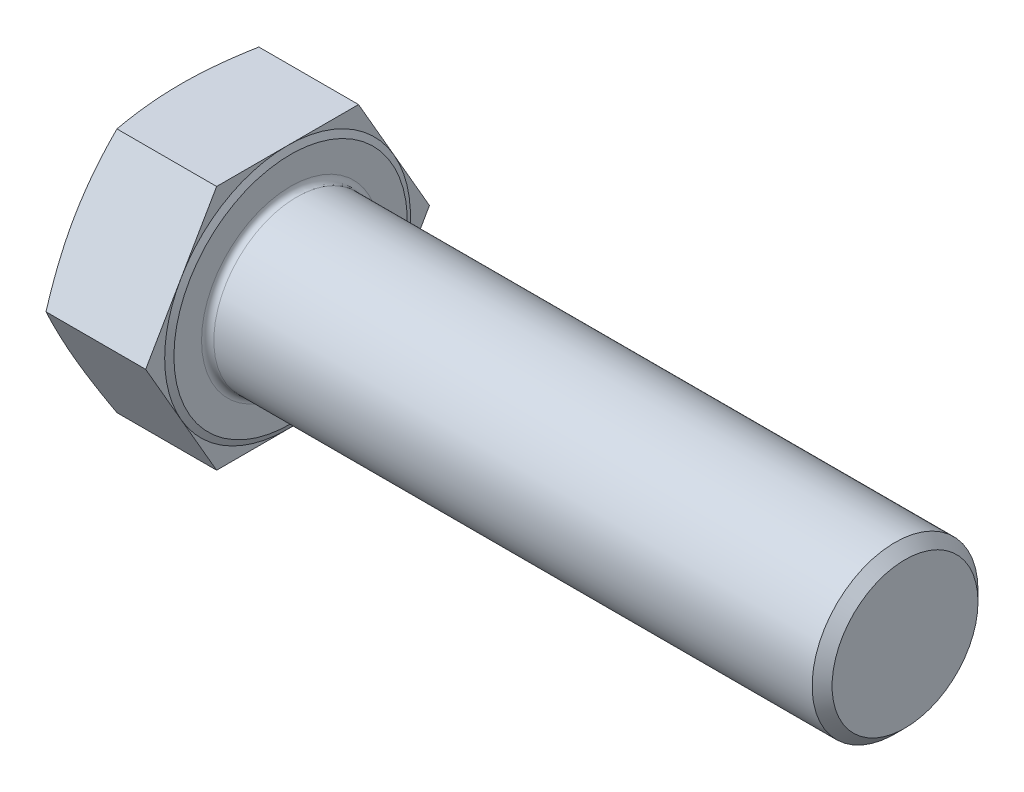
ISO-10303-21;
HEADER;
FILE_DESCRIPTION(('STEP AP214'),'2;1');
FILE_NAME('part.step','',(''),(''),'','','');
FILE_SCHEMA(('AUTOMOTIVE_DESIGN { 1 0 10303 214 1 1 1 1 }'));
ENDSEC;
DATA;
#1=APPLICATION_CONTEXT('core data for automotive mechanical design processes');
#2=APPLICATION_PROTOCOL_DEFINITION('international standard','automotive_design',2000,#1);
#3=PRODUCT_CONTEXT('',#1,'mechanical');
#4=PRODUCT('Part','Part','',(#3));
#5=PRODUCT_RELATED_PRODUCT_CATEGORY('part','',(#4));
#6=PRODUCT_DEFINITION_FORMATION('','',#4);
#7=PRODUCT_DEFINITION_CONTEXT('part definition',#1,'design');
#8=PRODUCT_DEFINITION('design','',#6,#7);
#9=PRODUCT_DEFINITION_SHAPE('','',#8);
#10=(LENGTH_UNIT() NAMED_UNIT(*) SI_UNIT(.MILLI.,.METRE.));
#11=(NAMED_UNIT(*) PLANE_ANGLE_UNIT() SI_UNIT($,.RADIAN.));
#12=(NAMED_UNIT(*) SI_UNIT($,.STERADIAN.) SOLID_ANGLE_UNIT());
#13=UNCERTAINTY_MEASURE_WITH_UNIT(LENGTH_MEASURE(1.E-05),#10,'distance_accuracy_value','');
#14=(GEOMETRIC_REPRESENTATION_CONTEXT(3) GLOBAL_UNCERTAINTY_ASSIGNED_CONTEXT((#13)) GLOBAL_UNIT_ASSIGNED_CONTEXT((#10,
#11,#12)) REPRESENTATION_CONTEXT('',''));
#15=CARTESIAN_POINT('',(0.,0.,0.));
#16=DIRECTION('',(0.,0.,1.));
#17=DIRECTION('',(1.,0.,0.));
#18=AXIS2_PLACEMENT_3D('',#15,#16,#17);
#19=CARTESIAN_POINT('',(17.85,0.,0.));
#20=DIRECTION('',(1.,0.,0.));
#21=DIRECTION('',(0.,0.,-1.));
#22=AXIS2_PLACEMENT_3D('',#19,#20,#21);
#23=PLANE('',#22);
#24=CARTESIAN_POINT('',(17.85,0.,0.));
#25=DIRECTION('',(1.,0.,0.));
#26=DIRECTION('',(0.,0.,-1.));
#27=AXIS2_PLACEMENT_3D('',#24,#25,#26);
#28=CIRCLE('',#27,14.5);
#29=CARTESIAN_POINT('',(17.85,0.,-14.5));
#30=VERTEX_POINT('',#29);
#31=EDGE_CURVE('E188',#30,#30,#28,.F.);
#32=ORIENTED_EDGE('',*,*,#31,.T.);
#33=EDGE_LOOP('',(#32));
#34=FACE_BOUND('',#33,.T.);
#35=CARTESIAN_POINT('',(17.85,0.,0.));
#36=DIRECTION('',(-1.,0.,0.));
#37=DIRECTION('',(0.,0.,1.));
#38=AXIS2_PLACEMENT_3D('',#35,#36,#37);
#39=CIRCLE('',#38,19.);
#40=CARTESIAN_POINT('',(17.85,0.,19.));
#41=VERTEX_POINT('',#40);
#42=EDGE_CURVE('E139',#41,#41,#39,.T.);
#43=ORIENTED_EDGE('',*,*,#42,.F.);
#44=EDGE_LOOP('',(#43));
#45=FACE_BOUND('',#44,.T.);
#46=ADVANCED_FACE('F33',(#34,#45),#23,.T.);
#47=CARTESIAN_POINT('',(17.35,0.,-23.0940107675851));
#48=DIRECTION('',(1.,0.,0.));
#49=DIRECTION('',(0.,0.,-1.));
#50=AXIS2_PLACEMENT_3D('',#47,#48,#49);
#51=PLANE('',#50);
#52=DIRECTION('',(0.,-0.866025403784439,0.5));
#53=VECTOR('',#52,1.);
#54=CARTESIAN_POINT('',(17.35,20.,11.5470053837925));
#55=LINE('',#54,#53);
#56=CARTESIAN_POINT('',(17.35,20.,11.5470053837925));
#57=VERTEX_POINT('',#56);
#58=CARTESIAN_POINT('',(17.35,9.99999999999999,17.3205080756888));
#59=VERTEX_POINT('',#58);
#60=EDGE_CURVE('E138',#57,#59,#55,.T.);
#61=ORIENTED_EDGE('',*,*,#60,.T.);
#62=CARTESIAN_POINT('',(17.35,0.,0.));
#63=DIRECTION('',(-1.,0.,0.));
#64=DIRECTION('',(0.,0.,1.));
#65=AXIS2_PLACEMENT_3D('',#62,#63,#64);
#66=CIRCLE('',#65,20.);
#67=CARTESIAN_POINT('',(17.35,20.,0.));
#68=VERTEX_POINT('',#67);
#69=EDGE_CURVE('E49',#59,#68,#66,.T.);
#70=ORIENTED_EDGE('',*,*,#69,.T.);
#71=DIRECTION('',(0.,0.,1.));
#72=VECTOR('',#71,1.);
#73=CARTESIAN_POINT('',(17.35,20.,-11.5470053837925));
#74=LINE('',#73,#72);
#75=EDGE_CURVE('E135',#68,#57,#74,.T.);
#76=ORIENTED_EDGE('',*,*,#75,.T.);
#77=EDGE_LOOP('',(#61,#70,#76));
#78=FACE_BOUND('',#77,.T.);
#79=ADVANCED_FACE('F134',(#78),#51,.T.);
#80=CARTESIAN_POINT('',(17.35,20.,-11.5470053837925));
#81=VERTEX_POINT('',#80);
#82=EDGE_CURVE('E145',#81,#68,#74,.T.);
#83=ORIENTED_EDGE('',*,*,#82,.T.);
#84=CARTESIAN_POINT('',(17.35,10.,-17.3205080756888));
#85=VERTEX_POINT('',#84);
#86=EDGE_CURVE('E122',#68,#85,#66,.T.);
#87=ORIENTED_EDGE('',*,*,#86,.T.);
#88=DIRECTION('',(0.,0.866025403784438,0.5));
#89=VECTOR('',#88,1.);
#90=CARTESIAN_POINT('',(17.35,0.,-23.0940107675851));
#91=LINE('',#90,#89);
#92=EDGE_CURVE('E151',#85,#81,#91,.T.);
#93=ORIENTED_EDGE('',*,*,#92,.T.);
#94=EDGE_LOOP('',(#83,#87,#93));
#95=FACE_BOUND('',#94,.T.);
#96=ADVANCED_FACE('F150',(#95),#51,.T.);
#97=CARTESIAN_POINT('',(17.35,0.,-23.0940107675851));
#98=VERTEX_POINT('',#97);
#99=EDGE_CURVE('E148',#98,#85,#91,.T.);
#100=ORIENTED_EDGE('',*,*,#99,.T.);
#101=CARTESIAN_POINT('',(17.35,-10.,-17.3205080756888));
#102=VERTEX_POINT('',#101);
#103=EDGE_CURVE('E125',#85,#102,#66,.T.);
#104=ORIENTED_EDGE('',*,*,#103,.T.);
#105=DIRECTION('',(0.,0.866025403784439,-0.5));
#106=VECTOR('',#105,1.);
#107=CARTESIAN_POINT('',(17.35,-20.,-11.5470053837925));
#108=LINE('',#107,#106);
#109=EDGE_CURVE('E306',#102,#98,#108,.T.);
#110=ORIENTED_EDGE('',*,*,#109,.T.);
#111=EDGE_LOOP('',(#100,#104,#110));
#112=FACE_BOUND('',#111,.T.);
#113=ADVANCED_FACE('F337',(#112),#51,.T.);
#114=CARTESIAN_POINT('',(17.35,-20.,-11.5470053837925));
#115=VERTEX_POINT('',#114);
#116=EDGE_CURVE('E304',#115,#102,#108,.T.);
#117=ORIENTED_EDGE('',*,*,#116,.T.);
#118=CARTESIAN_POINT('',(17.35,-20.,0.));
#119=VERTEX_POINT('',#118);
#120=EDGE_CURVE('E338',#102,#119,#66,.T.);
#121=ORIENTED_EDGE('',*,*,#120,.T.);
#122=DIRECTION('',(0.,0.,-1.));
#123=VECTOR('',#122,1.);
#124=CARTESIAN_POINT('',(17.35,-20.,11.5470053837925));
#125=LINE('',#124,#123);
#126=EDGE_CURVE('E162',#119,#115,#125,.T.);
#127=ORIENTED_EDGE('',*,*,#126,.T.);
#128=EDGE_LOOP('',(#117,#121,#127));
#129=FACE_BOUND('',#128,.T.);
#130=ADVANCED_FACE('F352',(#129),#51,.T.);
#131=CARTESIAN_POINT('',(17.35,-20.,11.5470053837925));
#132=VERTEX_POINT('',#131);
#133=EDGE_CURVE('E163',#132,#119,#125,.T.);
#134=ORIENTED_EDGE('',*,*,#133,.T.);
#135=CARTESIAN_POINT('',(17.35,-10.,17.3205080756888));
#136=VERTEX_POINT('',#135);
#137=EDGE_CURVE('E339',#119,#136,#66,.T.);
#138=ORIENTED_EDGE('',*,*,#137,.T.);
#139=DIRECTION('',(0.,-0.866025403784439,-0.5));
#140=VECTOR('',#139,1.);
#141=CARTESIAN_POINT('',(17.35,0.,23.094010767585));
#142=LINE('',#141,#140);
#143=EDGE_CURVE('E158',#136,#132,#142,.T.);
#144=ORIENTED_EDGE('',*,*,#143,.T.);
#145=EDGE_LOOP('',(#134,#138,#144));
#146=FACE_BOUND('',#145,.T.);
#147=ADVANCED_FACE('F347',(#146),#51,.T.);
#148=CARTESIAN_POINT('',(17.35,0.,23.094010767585));
#149=VERTEX_POINT('',#148);
#150=EDGE_CURVE('E159',#149,#136,#142,.T.);
#151=ORIENTED_EDGE('',*,*,#150,.T.);
#152=EDGE_CURVE('E140',#136,#59,#66,.T.);
#153=ORIENTED_EDGE('',*,*,#152,.T.);
#154=EDGE_CURVE('E153',#59,#149,#55,.T.);
#155=ORIENTED_EDGE('',*,*,#154,.T.);
#156=EDGE_LOOP('',(#151,#153,#155));
#157=FACE_BOUND('',#156,.T.);
#158=ADVANCED_FACE('F213',(#157),#51,.T.);
#159=CARTESIAN_POINT('',(17.35,-20.,-11.5470053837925));
#160=DIRECTION('',(0.,0.5,0.866025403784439));
#161=DIRECTION('',(0.,-0.866025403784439,0.5));
#162=AXIS2_PLACEMENT_3D('',#159,#160,#161);
#163=PLANE('',#162);
#164=CARTESIAN_POINT('',(1.12616985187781,0.000199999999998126,-23.0941262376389));
#165=CARTESIAN_POINT('',(1.03913935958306,-0.413988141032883,-22.8549946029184));
#166=CARTESIAN_POINT('',(0.956022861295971,-0.828784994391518,-22.6155115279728));
#167=CARTESIAN_POINT('',(0.79847887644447,-1.65965264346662,-22.1358098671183));
#168=CARTESIAN_POINT('',(0.724052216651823,-2.07572355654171,-21.8955912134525));
#169=CARTESIAN_POINT('',(0.515026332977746,-3.32638990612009,-21.173518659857));
#170=CARTESIAN_POINT('',(0.39480393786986,-4.16286638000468,-20.6905787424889));
#171=CARTESIAN_POINT('',(0.248695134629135,-5.41653139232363,-19.966774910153));
#172=CARTESIAN_POINT('',(0.20582014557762,-5.83227350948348,-19.7267460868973));
#173=CARTESIAN_POINT('',(0.1317782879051,-6.66453397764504,-19.2462402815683));
#174=CARTESIAN_POINT('',(0.100610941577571,-7.08105229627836,-19.0057633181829));
#175=CARTESIAN_POINT('',(0.0505287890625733,-7.91449906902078,-18.5245725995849));
#176=CARTESIAN_POINT('',(0.0316097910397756,-8.33142733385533,-18.2838589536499));
#177=CARTESIAN_POINT('',(0.00634541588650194,-9.16557039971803,-17.8022662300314));
#178=CARTESIAN_POINT('',(0.,-9.58278519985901,-17.5613871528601));
#179=CARTESIAN_POINT('',(0.,-10.417214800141,-17.0796289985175));
#180=CARTESIAN_POINT('',(0.00634541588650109,-10.834429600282,-16.8387499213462));
#181=CARTESIAN_POINT('',(0.0316097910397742,-11.6685726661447,-16.3571571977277));
#182=CARTESIAN_POINT('',(0.0505287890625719,-12.0855009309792,-16.1164435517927));
#183=CARTESIAN_POINT('',(0.100610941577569,-12.9189477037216,-15.6352528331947));
#184=CARTESIAN_POINT('',(0.131778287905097,-13.335466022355,-15.3947758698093));
#185=CARTESIAN_POINT('',(0.205820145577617,-14.1677264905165,-14.9142700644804));
#186=CARTESIAN_POINT('',(0.248695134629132,-14.5834686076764,-14.6742412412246));
#187=CARTESIAN_POINT('',(0.394803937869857,-15.8371336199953,-13.9504374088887));
#188=CARTESIAN_POINT('',(0.515026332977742,-16.6736100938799,-13.4674974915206));
#189=CARTESIAN_POINT('',(0.724052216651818,-17.9242764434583,-12.7454249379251));
#190=CARTESIAN_POINT('',(0.798478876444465,-18.3403473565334,-12.5052062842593));
#191=CARTESIAN_POINT('',(0.956022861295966,-19.1712150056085,-12.0255046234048));
#192=CARTESIAN_POINT('',(1.03913935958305,-19.5860118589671,-11.7860215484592));
#193=CARTESIAN_POINT('',(1.12616985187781,-20.0002,-11.5468899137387));
#194=B_SPLINE_CURVE_WITH_KNOTS('',3,(#164,#165,#166,#167,#168,#169,#170,#171,#172,#173,#174,
#175,#176,#177,#178,#179,#180,#181,#182,#183,#184,#185,#186,#187,#188,#189,#190,#191,#192,#193),
.UNSPECIFIED.,.F.,.F.,(4,2,2,2,2,2,2,2,2,2,2,2,2,2,4),(0.,1.45830867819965,2.91675599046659,
5.83566674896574,7.28145814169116,8.72719053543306,10.1724278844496,11.6176607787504,
13.0628936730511,14.5081310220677,15.9538634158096,17.399654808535,20.3185655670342,
21.7770128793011,23.2353215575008),.UNSPECIFIED.);
#195=CARTESIAN_POINT('',(1.12612782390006,0.,-23.0940107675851));
#196=VERTEX_POINT('',#195);
#197=CARTESIAN_POINT('',(0.,-10.,-17.3205080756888));
#198=VERTEX_POINT('',#197);
#199=EDGE_CURVE('E321',#196,#198,#194,.T.);
#200=ORIENTED_EDGE('',*,*,#199,.F.);
#201=DIRECTION('',(-1.,0.,0.));
#202=VECTOR('',#201,1.);
#203=CARTESIAN_POINT('',(17.35,0.,-23.0940107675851));
#204=LINE('',#203,#202);
#205=EDGE_CURVE('E178',#98,#196,#204,.T.);
#206=ORIENTED_EDGE('',*,*,#205,.F.);
#207=ORIENTED_EDGE('',*,*,#109,.F.);
#208=ORIENTED_EDGE('',*,*,#116,.F.);
#209=DIRECTION('',(-1.,0.,0.));
#210=VECTOR('',#209,1.);
#211=CARTESIAN_POINT('',(17.35,-20.,-11.5470053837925));
#212=LINE('',#211,#210);
#213=CARTESIAN_POINT('',(1.12612782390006,-20.,-11.5470053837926));
#214=VERTEX_POINT('',#213);
#215=EDGE_CURVE('E166',#115,#214,#212,.T.);
#216=ORIENTED_EDGE('',*,*,#215,.T.);
#217=EDGE_CURVE('E246',#198,#214,#194,.T.);
#218=ORIENTED_EDGE('',*,*,#217,.F.);
#219=EDGE_LOOP('',(#200,#206,#207,#208,#216,#218));
#220=FACE_BOUND('',#219,.T.);
#221=ADVANCED_FACE('F35',(#220),#163,.F.);
#222=CARTESIAN_POINT('',(17.35,0.,-23.0940107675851));
#223=DIRECTION('',(0.,-0.5,0.866025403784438));
#224=DIRECTION('',(0.,-0.866025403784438,-0.5));
#225=AXIS2_PLACEMENT_3D('',#222,#223,#224);
#226=PLANE('',#225);
#227=CARTESIAN_POINT('',(1.12616985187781,20.0002,-11.5468899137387));
#228=CARTESIAN_POINT('',(1.03913935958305,19.5860118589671,-11.7860215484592));
#229=CARTESIAN_POINT('',(0.956022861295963,19.1712150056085,-12.0255046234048));
#230=CARTESIAN_POINT('',(0.798478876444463,18.3403473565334,-12.5052062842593));
#231=CARTESIAN_POINT('',(0.724052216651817,17.9242764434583,-12.7454249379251));
#232=CARTESIAN_POINT('',(0.51502633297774,16.6736100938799,-13.4674974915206));
#233=CARTESIAN_POINT('',(0.394803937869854,15.8371336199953,-13.9504374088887));
#234=CARTESIAN_POINT('',(0.248695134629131,14.5834686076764,-14.6742412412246));
#235=CARTESIAN_POINT('',(0.205820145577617,14.1677264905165,-14.9142700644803));
#236=CARTESIAN_POINT('',(0.131778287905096,13.335466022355,-15.3947758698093));
#237=CARTESIAN_POINT('',(0.100610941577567,12.9189477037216,-15.6352528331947));
#238=CARTESIAN_POINT('',(0.0505287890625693,12.0855009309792,-16.1164435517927));
#239=CARTESIAN_POINT('',(0.0316097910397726,11.6685726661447,-16.3571571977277));
#240=CARTESIAN_POINT('',(0.00634541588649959,10.834429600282,-16.8387499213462));
#241=CARTESIAN_POINT('',(0.,10.417214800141,-17.0796289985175));
#242=CARTESIAN_POINT('',(0.,9.58278519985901,-17.5613871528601));
#243=CARTESIAN_POINT('',(0.00634541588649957,9.16557039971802,-17.8022662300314));
#244=CARTESIAN_POINT('',(0.0316097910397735,8.33142733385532,-18.2838589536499));
#245=CARTESIAN_POINT('',(0.0505287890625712,7.91449906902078,-18.5245725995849));
#246=CARTESIAN_POINT('',(0.10061094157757,7.08105229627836,-19.0057633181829));
#247=CARTESIAN_POINT('',(0.131778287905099,6.66453397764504,-19.2462402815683));
#248=CARTESIAN_POINT('',(0.20582014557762,5.83227350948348,-19.7267460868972));
#249=CARTESIAN_POINT('',(0.248695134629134,5.41653139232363,-19.9667749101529));
#250=CARTESIAN_POINT('',(0.394803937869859,4.16286638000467,-20.6905787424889));
#251=CARTESIAN_POINT('',(0.515026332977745,3.32638990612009,-21.173518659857));
#252=CARTESIAN_POINT('',(0.724052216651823,2.07572355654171,-21.8955912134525));
#253=CARTESIAN_POINT('',(0.79847887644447,1.65965264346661,-22.1358098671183));
#254=CARTESIAN_POINT('',(0.956022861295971,0.828784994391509,-22.6155115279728));
#255=CARTESIAN_POINT('',(1.03913935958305,0.413988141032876,-22.8549946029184));
#256=CARTESIAN_POINT('',(1.12616985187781,-0.000200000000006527,-23.0941262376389));
#257=B_SPLINE_CURVE_WITH_KNOTS('',3,(#227,#228,#229,#230,#231,#232,#233,#234,#235,#236,#237,
#238,#239,#240,#241,#242,#243,#244,#245,#246,#247,#248,#249,#250,#251,#252,#253,#254,#255,#256),
.UNSPECIFIED.,.F.,.F.,(4,2,2,2,2,2,2,2,2,2,2,2,2,2,4),(0.,1.45830867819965,2.91675599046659,
5.83566674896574,7.28145814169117,8.72719053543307,10.1724278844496,11.6176607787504,
13.0628936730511,14.5081310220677,15.9538634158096,17.399654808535,20.3185655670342,
21.7770128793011,23.2353215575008),.UNSPECIFIED.);
#258=CARTESIAN_POINT('',(1.12612782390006,20.,-11.5470053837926));
#259=VERTEX_POINT('',#258);
#260=CARTESIAN_POINT('',(0.,10.,-17.3205080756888));
#261=VERTEX_POINT('',#260);
#262=EDGE_CURVE('E261',#259,#261,#257,.T.);
#263=ORIENTED_EDGE('',*,*,#262,.F.);
#264=DIRECTION('',(-1.,0.,0.));
#265=VECTOR('',#264,1.);
#266=CARTESIAN_POINT('',(17.35,20.,-11.5470053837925));
#267=LINE('',#266,#265);
#268=EDGE_CURVE('E176',#81,#259,#267,.T.);
#269=ORIENTED_EDGE('',*,*,#268,.F.);
#270=ORIENTED_EDGE('',*,*,#92,.F.);
#271=ORIENTED_EDGE('',*,*,#99,.F.);
#272=ORIENTED_EDGE('',*,*,#205,.T.);
#273=EDGE_CURVE('E257',#261,#196,#257,.T.);
#274=ORIENTED_EDGE('',*,*,#273,.F.);
#275=EDGE_LOOP('',(#263,#269,#270,#271,#272,#274));
#276=FACE_BOUND('',#275,.T.);
#277=ADVANCED_FACE('F267',(#276),#226,.F.);
#278=CARTESIAN_POINT('',(17.35,20.,-11.5470053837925));
#279=DIRECTION('',(0.,-1.,0.));
#280=DIRECTION('',(0.,0.,-1.));
#281=AXIS2_PLACEMENT_3D('',#278,#279,#280);
#282=PLANE('',#281);
#283=CARTESIAN_POINT('',(6.01758049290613,20.,-30.5724100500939));
#284=CARTESIAN_POINT('',(5.87978017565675,20.,-30.119980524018));
#285=CARTESIAN_POINT('',(5.74281320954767,20.,-29.667297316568));
#286=CARTESIAN_POINT('',(5.47073254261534,20.,-28.7613715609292));
#287=CARTESIAN_POINT('',(5.33561885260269,20.,-28.3081290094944));
#288=CARTESIAN_POINT('',(4.93332011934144,20.,-26.9474252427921));
#289=CARTESIAN_POINT('',(4.66919783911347,20.,-26.0390547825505));
#290=CARTESIAN_POINT('',(4.1505185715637,20.,-24.2177476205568));
#291=CARTESIAN_POINT('',(3.89598035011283,20.,-23.3048055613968));
#292=CARTESIAN_POINT('',(3.39942734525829,20.,-21.4755258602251));
#293=CARTESIAN_POINT('',(3.15741233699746,20.,-20.5591882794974));
#294=CARTESIAN_POINT('',(2.69190185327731,20.,-18.733829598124));
#295=CARTESIAN_POINT('',(2.46821483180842,20.,-17.8248575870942));
#296=CARTESIAN_POINT('',(2.03988475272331,20.,-16.0023904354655));
#297=CARTESIAN_POINT('',(1.83524201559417,20.,-15.0888952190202));
#298=CARTESIAN_POINT('',(1.4497719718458,20.,-13.2571772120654));
#299=CARTESIAN_POINT('',(1.26893654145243,20.,-12.3389561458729));
#300=CARTESIAN_POINT('',(0.936587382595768,20.,-10.4971831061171));
#301=CARTESIAN_POINT('',(0.785072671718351,20.,-9.57363131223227));
#302=CARTESIAN_POINT('',(0.532522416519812,20.,-7.825192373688));
#303=CARTESIAN_POINT('',(0.427731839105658,20.,-7.00085271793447));
#304=CARTESIAN_POINT('',(0.25034635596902,20.,-5.3486876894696));
#305=CARTESIAN_POINT('',(0.177750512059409,20.,-4.52086241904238));
#306=CARTESIAN_POINT('',(0.0682505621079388,20.,-2.86340529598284));
#307=CARTESIAN_POINT('',(0.0313212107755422,20.,-2.03377513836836));
#308=CARTESIAN_POINT('',(-0.00497602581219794,20.,-0.373684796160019));
#309=CARTESIAN_POINT('',(-0.00434417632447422,20.,0.456775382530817));
#310=CARTESIAN_POINT('',(0.034545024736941,20.,2.12101364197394));
#311=CARTESIAN_POINT('',(0.0729931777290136,20.,2.95478718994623));
#312=CARTESIAN_POINT('',(0.185745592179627,20.,4.61988528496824));
#313=CARTESIAN_POINT('',(0.260050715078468,20.,5.4512097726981));
#314=CARTESIAN_POINT('',(0.441041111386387,20.,7.11099925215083));
#315=CARTESIAN_POINT('',(0.547754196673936,20.,7.93946116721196));
#316=CARTESIAN_POINT('',(0.789231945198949,20.,9.59224040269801));
#317=CARTESIAN_POINT('',(0.923996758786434,20.,10.4165577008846));
#318=CARTESIAN_POINT('',(1.22494677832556,20.,12.1044246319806));
#319=CARTESIAN_POINT('',(1.39241690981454,20.,12.9677431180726));
#320=CARTESIAN_POINT('',(1.74891156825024,20.,14.6899467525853));
#321=CARTESIAN_POINT('',(1.93793772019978,20.,15.5488315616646));
#322=CARTESIAN_POINT('',(2.33357526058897,20.,17.26277987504));
#323=CARTESIAN_POINT('',(2.54019175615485,20.,18.1178421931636));
#324=CARTESIAN_POINT('',(2.96764893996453,20.,19.8243648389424));
#325=CARTESIAN_POINT('',(3.18848928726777,20.,20.6758252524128));
#326=CARTESIAN_POINT('',(3.64202645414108,20.,22.3767425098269));
#327=CARTESIAN_POINT('',(3.87473813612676,20.,23.2261953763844));
#328=CARTESIAN_POINT('',(4.34962796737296,20.,24.9224472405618));
#329=CARTESIAN_POINT('',(4.59180615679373,20.,25.7692462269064));
#330=CARTESIAN_POINT('',(5.08389632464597,20.,27.4604350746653));
#331=CARTESIAN_POINT('',(5.3338069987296,20.,28.304825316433));
#332=CARTESIAN_POINT('',(5.84005731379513,20.,29.9916711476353));
#333=CARTESIAN_POINT('',(6.09639694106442,20.,30.8341267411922));
#334=CARTESIAN_POINT('',(6.6115742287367,20.,32.5080933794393));
#335=CARTESIAN_POINT('',(6.87035305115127,20.,33.339622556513));
#336=CARTESIAN_POINT('',(7.39231955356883,20.,35.0012973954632));
#337=CARTESIAN_POINT('',(7.65550724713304,20.,35.8314430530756));
#338=CARTESIAN_POINT('',(8.18562832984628,20.,37.4905771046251));
#339=CARTESIAN_POINT('',(8.45256188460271,20.,38.3195654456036));
#340=CARTESIAN_POINT('',(8.98961416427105,20.,39.9765099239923));
#341=CARTESIAN_POINT('',(9.25973289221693,20.,40.8044660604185));
#342=CARTESIAN_POINT('',(9.80167371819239,20.,42.4563397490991));
#343=CARTESIAN_POINT('',(10.0734854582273,20.,43.280260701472));
#344=CARTESIAN_POINT('',(10.6194544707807,20.,44.9273252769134));
#345=CARTESIAN_POINT('',(10.8936117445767,20.,45.7504688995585));
#346=CARTESIAN_POINT('',(11.4439401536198,20.,47.396007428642));
#347=CARTESIAN_POINT('',(11.7201111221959,20.,48.2184023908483));
#348=CARTESIAN_POINT('',(12.2742400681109,20.,49.8625879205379));
#349=CARTESIAN_POINT('',(12.552198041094,20.,50.6843784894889));
#350=CARTESIAN_POINT('',(12.8309256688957,20.,51.5059072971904));
#351=B_SPLINE_CURVE_WITH_KNOTS('',3,(#283,#284,#285,#286,#287,#288,#289,#290,#291,#292,#293,
#294,#295,#296,#297,#298,#299,#300,#301,#302,#303,#304,#305,#306,#307,#308,#309,#310,#311,#312,
#313,#314,#315,#316,#317,#318,#319,#320,#321,#322,#323,#324,#325,#326,#327,#328,#329,#330,#331,
#332,#333,#334,#335,#336,#337,#338,#339,#340,#341,#342,#343,#344,#345,#346,#347,#348,#349,#350),
.UNSPECIFIED.,.F.,.F.,(4,2,2,2,2,2,2,2,2,2,2,2,2,2,2,2,2,2,2,2,2,2,2,2,2,2,2,2,2,2,2,2,2,4),(0.,
1.41884754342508,2.83770335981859,5.67562473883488,8.51884097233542,11.3620061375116,
14.1701165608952,16.9782742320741,19.7854711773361,22.5925740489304,25.0849472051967,
27.5772477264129,30.0677828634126,32.558300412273,35.0614486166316,37.5646569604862,
40.0700196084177,42.5753956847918,45.2132935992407,47.8513905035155,50.4902559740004,
53.1290582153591,55.7712493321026,58.4134516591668,61.0552106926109,63.6969640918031,
66.3095471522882,68.9221382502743,71.5348452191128,74.1475546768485,76.7503465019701,
79.3531397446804,81.9557199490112,84.5582938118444),.UNSPECIFIED.);
#352=CARTESIAN_POINT('',(1.12612782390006,20.0000000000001,11.5470053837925));
#353=VERTEX_POINT('',#352);
#354=CARTESIAN_POINT('',(0.,20.,0.));
#355=VERTEX_POINT('',#354);
#356=EDGE_CURVE('E57',#353,#355,#351,.F.);
#357=ORIENTED_EDGE('',*,*,#356,.F.);
#358=DIRECTION('',(-1.,0.,0.));
#359=VECTOR('',#358,1.);
#360=CARTESIAN_POINT('',(17.35,20.,11.5470053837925));
#361=LINE('',#360,#359);
#362=EDGE_CURVE('E147',#57,#353,#361,.T.);
#363=ORIENTED_EDGE('',*,*,#362,.F.);
#364=ORIENTED_EDGE('',*,*,#75,.F.);
#365=ORIENTED_EDGE('',*,*,#82,.F.);
#366=ORIENTED_EDGE('',*,*,#268,.T.);
#367=EDGE_CURVE('E262',#355,#259,#351,.F.);
#368=ORIENTED_EDGE('',*,*,#367,.F.);
#369=EDGE_LOOP('',(#357,#363,#364,#365,#366,#368));
#370=FACE_BOUND('',#369,.T.);
#371=ADVANCED_FACE('F143',(#370),#282,.F.);
#372=CARTESIAN_POINT('',(17.35,20.,11.5470053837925));
#373=DIRECTION('',(0.,-0.5,-0.866025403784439));
#374=DIRECTION('',(0.,0.866025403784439,-0.5));
#375=AXIS2_PLACEMENT_3D('',#372,#373,#374);
#376=PLANE('',#375);
#377=CARTESIAN_POINT('',(1.1261698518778,-0.000200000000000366,23.0941262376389));
#378=CARTESIAN_POINT('',(1.03913935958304,0.413988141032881,22.8549946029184));
#379=CARTESIAN_POINT('',(0.956022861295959,0.828784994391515,22.6155115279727));
#380=CARTESIAN_POINT('',(0.798478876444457,1.65965264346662,22.1358098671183));
#381=CARTESIAN_POINT('',(0.724052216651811,2.07572355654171,21.8955912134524));
#382=CARTESIAN_POINT('',(0.515026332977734,3.32638990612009,21.1735186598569));
#383=CARTESIAN_POINT('',(0.394803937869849,4.16286638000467,20.6905787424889));
#384=CARTESIAN_POINT('',(0.248695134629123,5.41653139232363,19.9667749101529));
#385=CARTESIAN_POINT('',(0.205820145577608,5.83227350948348,19.7267460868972));
#386=CARTESIAN_POINT('',(0.131778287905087,6.66453397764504,19.2462402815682));
#387=CARTESIAN_POINT('',(0.100610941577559,7.08105229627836,19.0057633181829));
#388=CARTESIAN_POINT('',(0.050528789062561,7.91449906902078,18.5245725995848));
#389=CARTESIAN_POINT('',(0.0316097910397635,8.33142733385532,18.2838589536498));
#390=CARTESIAN_POINT('',(0.00634541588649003,9.16557039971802,17.8022662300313));
#391=CARTESIAN_POINT('',(0.,9.58278519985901,17.5613871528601));
#392=CARTESIAN_POINT('',(0.,10.417214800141,17.0796289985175));
#393=CARTESIAN_POINT('',(0.00634541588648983,10.834429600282,16.8387499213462));
#394=CARTESIAN_POINT('',(0.031609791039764,11.6685726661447,16.3571571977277));
#395=CARTESIAN_POINT('',(0.0505287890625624,12.0855009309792,16.1164435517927));
#396=CARTESIAN_POINT('',(0.100610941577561,12.9189477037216,15.6352528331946));
#397=CARTESIAN_POINT('',(0.13177828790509,13.335466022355,15.3947758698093));
#398=CARTESIAN_POINT('',(0.20582014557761,14.1677264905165,14.9142700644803));
#399=CARTESIAN_POINT('',(0.248695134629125,14.5834686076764,14.6742412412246));
#400=CARTESIAN_POINT('',(0.394803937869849,15.8371336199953,13.9504374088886));
#401=CARTESIAN_POINT('',(0.515026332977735,16.6736100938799,13.4674974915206));
#402=CARTESIAN_POINT('',(0.724052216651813,17.9242764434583,12.7454249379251));
#403=CARTESIAN_POINT('',(0.79847887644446,18.3403473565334,12.5052062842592));
#404=CARTESIAN_POINT('',(0.956022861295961,19.1712150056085,12.0255046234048));
#405=CARTESIAN_POINT('',(1.03913935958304,19.5860118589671,11.7860215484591));
#406=CARTESIAN_POINT('',(1.1261698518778,20.0002,11.5468899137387));
#407=B_SPLINE_CURVE_WITH_KNOTS('',3,(#377,#378,#379,#380,#381,#382,#383,#384,#385,#386,#387,
#388,#389,#390,#391,#392,#393,#394,#395,#396,#397,#398,#399,#400,#401,#402,#403,#404,#405,#406),
.UNSPECIFIED.,.F.,.F.,(4,2,2,2,2,2,2,2,2,2,2,2,2,2,4),(0.,1.45830867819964,2.91675599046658,
5.83566674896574,7.28145814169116,8.72719053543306,10.1724278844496,11.6176607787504,
13.0628936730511,14.5081310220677,15.9538634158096,17.399654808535,20.3185655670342,
21.7770128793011,23.2353215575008),.UNSPECIFIED.);
#408=CARTESIAN_POINT('',(1.12612782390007,0.,23.0940107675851));
#409=VERTEX_POINT('',#408);
#410=CARTESIAN_POINT('',(0.,10.,17.3205080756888));
#411=VERTEX_POINT('',#410);
#412=EDGE_CURVE('E251',#409,#411,#407,.T.);
#413=ORIENTED_EDGE('',*,*,#412,.F.);
#414=DIRECTION('',(-1.,0.,0.));
#415=VECTOR('',#414,1.);
#416=CARTESIAN_POINT('',(17.35,0.,23.094010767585));
#417=LINE('',#416,#415);
#418=EDGE_CURVE('E172',#149,#409,#417,.T.);
#419=ORIENTED_EDGE('',*,*,#418,.F.);
#420=ORIENTED_EDGE('',*,*,#154,.F.);
#421=ORIENTED_EDGE('',*,*,#60,.F.);
#422=ORIENTED_EDGE('',*,*,#362,.T.);
#423=EDGE_CURVE('E312',#411,#353,#407,.T.);
#424=ORIENTED_EDGE('',*,*,#423,.F.);
#425=EDGE_LOOP('',(#413,#419,#420,#421,#422,#424));
#426=FACE_BOUND('',#425,.T.);
#427=ADVANCED_FACE('F273',(#426),#376,.F.);
#428=CARTESIAN_POINT('',(17.35,0.,23.094010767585));
#429=DIRECTION('',(0.,0.5,-0.866025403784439));
#430=DIRECTION('',(0.,0.866025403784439,0.5));
#431=AXIS2_PLACEMENT_3D('',#428,#429,#430);
#432=PLANE('',#431);
#433=CARTESIAN_POINT('',(1.1261698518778,-20.0002,11.5468899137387));
#434=CARTESIAN_POINT('',(1.03913935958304,-19.5860118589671,11.7860215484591));
#435=CARTESIAN_POINT('',(0.956022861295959,-19.1712150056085,12.0255046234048));
#436=CARTESIAN_POINT('',(0.798478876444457,-18.3403473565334,12.5052062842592));
#437=CARTESIAN_POINT('',(0.724052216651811,-17.9242764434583,12.7454249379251));
#438=CARTESIAN_POINT('',(0.515026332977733,-16.6736100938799,13.4674974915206));
#439=CARTESIAN_POINT('',(0.394803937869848,-15.8371336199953,13.9504374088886));
#440=CARTESIAN_POINT('',(0.248695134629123,-14.5834686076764,14.6742412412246));
#441=CARTESIAN_POINT('',(0.205820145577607,-14.1677264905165,14.9142700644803));
#442=CARTESIAN_POINT('',(0.131778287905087,-13.335466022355,15.3947758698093));
#443=CARTESIAN_POINT('',(0.100610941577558,-12.9189477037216,15.6352528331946));
#444=CARTESIAN_POINT('',(0.0505287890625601,-12.0855009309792,16.1164435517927));
#445=CARTESIAN_POINT('',(0.0316097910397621,-11.6685726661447,16.3571571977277));
#446=CARTESIAN_POINT('',(0.00634541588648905,-10.834429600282,16.8387499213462));
#447=CARTESIAN_POINT('',(0.,-10.417214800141,17.0796289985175));
#448=CARTESIAN_POINT('',(0.,-9.58278519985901,17.56138715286));
#449=CARTESIAN_POINT('',(0.0063454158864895,-9.16557039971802,17.8022662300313));
#450=CARTESIAN_POINT('',(0.0316097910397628,-8.33142733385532,18.2838589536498));
#451=CARTESIAN_POINT('',(0.0505287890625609,-7.91449906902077,18.5245725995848));
#452=CARTESIAN_POINT('',(0.100610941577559,-7.08105229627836,19.0057633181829));
#453=CARTESIAN_POINT('',(0.131778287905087,-6.66453397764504,19.2462402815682));
#454=CARTESIAN_POINT('',(0.205820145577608,-5.83227350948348,19.7267460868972));
#455=CARTESIAN_POINT('',(0.248695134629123,-5.41653139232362,19.9667749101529));
#456=CARTESIAN_POINT('',(0.394803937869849,-4.16286638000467,20.6905787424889));
#457=CARTESIAN_POINT('',(0.515026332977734,-3.32638990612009,21.1735186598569));
#458=CARTESIAN_POINT('',(0.724052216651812,-2.07572355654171,21.8955912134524));
#459=CARTESIAN_POINT('',(0.798478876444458,-1.65965264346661,22.1358098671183));
#460=CARTESIAN_POINT('',(0.956022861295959,-0.828784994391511,22.6155115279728));
#461=CARTESIAN_POINT('',(1.03913935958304,-0.413988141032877,22.8549946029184));
#462=CARTESIAN_POINT('',(1.1261698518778,0.000200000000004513,23.0941262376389));
#463=B_SPLINE_CURVE_WITH_KNOTS('',3,(#433,#434,#435,#436,#437,#438,#439,#440,#441,#442,#443,
#444,#445,#446,#447,#448,#449,#450,#451,#452,#453,#454,#455,#456,#457,#458,#459,#460,#461,#462),
.UNSPECIFIED.,.F.,.F.,(4,2,2,2,2,2,2,2,2,2,2,2,2,2,4),(0.,1.45830867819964,2.91675599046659,
5.83566674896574,7.28145814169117,8.72719053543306,10.1724278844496,11.6176607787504,
13.0628936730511,14.5081310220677,15.9538634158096,17.399654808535,20.3185655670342,
21.7770128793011,23.2353215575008),.UNSPECIFIED.);
#464=CARTESIAN_POINT('',(1.12612782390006,-20.,11.5470053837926));
#465=VERTEX_POINT('',#464);
#466=CARTESIAN_POINT('',(0.,-10.,17.3205080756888));
#467=VERTEX_POINT('',#466);
#468=EDGE_CURVE('E239',#465,#467,#463,.T.);
#469=ORIENTED_EDGE('',*,*,#468,.F.);
#470=DIRECTION('',(-1.,0.,0.));
#471=VECTOR('',#470,1.);
#472=CARTESIAN_POINT('',(17.35,-20.,11.5470053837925));
#473=LINE('',#472,#471);
#474=EDGE_CURVE('E169',#132,#465,#473,.T.);
#475=ORIENTED_EDGE('',*,*,#474,.F.);
#476=ORIENTED_EDGE('',*,*,#143,.F.);
#477=ORIENTED_EDGE('',*,*,#150,.F.);
#478=ORIENTED_EDGE('',*,*,#418,.T.);
#479=EDGE_CURVE('E317',#467,#409,#463,.T.);
#480=ORIENTED_EDGE('',*,*,#479,.F.);
#481=EDGE_LOOP('',(#469,#475,#476,#477,#478,#480));
#482=FACE_BOUND('',#481,.T.);
#483=ADVANCED_FACE('F276',(#482),#432,.F.);
#484=CARTESIAN_POINT('',(17.35,-20.,11.5470053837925));
#485=DIRECTION('',(0.,1.,0.));
#486=DIRECTION('',(0.,0.,1.));
#487=AXIS2_PLACEMENT_3D('',#484,#485,#486);
#488=PLANE('',#487);
#489=CARTESIAN_POINT('',(6.01758049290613,-20.,-30.572410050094));
#490=CARTESIAN_POINT('',(5.87978017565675,-20.,-30.1199805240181));
#491=CARTESIAN_POINT('',(5.74281320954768,-20.,-29.667297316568));
#492=CARTESIAN_POINT('',(5.47073254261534,-20.,-28.7613715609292));
#493=CARTESIAN_POINT('',(5.3356188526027,-20.,-28.3081290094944));
#494=CARTESIAN_POINT('',(4.93332011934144,-20.,-26.9474252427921));
#495=CARTESIAN_POINT('',(4.66919783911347,-20.,-26.0390547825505));
#496=CARTESIAN_POINT('',(4.1505185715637,-20.,-24.2177476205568));
#497=CARTESIAN_POINT('',(3.89598035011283,-20.,-23.3048055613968));
#498=CARTESIAN_POINT('',(3.39942734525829,-20.,-21.4755258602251));
#499=CARTESIAN_POINT('',(3.15741233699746,-20.,-20.5591882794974));
#500=CARTESIAN_POINT('',(2.69190185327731,-20.,-18.733829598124));
#501=CARTESIAN_POINT('',(2.46821483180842,-20.,-17.8248575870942));
#502=CARTESIAN_POINT('',(2.03988475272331,-20.,-16.0023904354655));
#503=CARTESIAN_POINT('',(1.83524201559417,-20.,-15.0888952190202));
#504=CARTESIAN_POINT('',(1.4497719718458,-20.,-13.2571772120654));
#505=CARTESIAN_POINT('',(1.26893654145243,-20.,-12.3389561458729));
#506=CARTESIAN_POINT('',(0.936587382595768,-20.,-10.4971831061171));
#507=CARTESIAN_POINT('',(0.785072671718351,-20.,-9.57363131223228));
#508=CARTESIAN_POINT('',(0.532522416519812,-20.,-7.82519237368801));
#509=CARTESIAN_POINT('',(0.427731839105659,-20.,-7.00085271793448));
#510=CARTESIAN_POINT('',(0.250346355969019,-20.,-5.34868768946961));
#511=CARTESIAN_POINT('',(0.177750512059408,-20.,-4.52086241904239));
#512=CARTESIAN_POINT('',(0.0682505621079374,-20.,-2.86340529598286));
#513=CARTESIAN_POINT('',(0.0313212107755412,-20.,-2.03377513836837));
#514=CARTESIAN_POINT('',(-0.00497602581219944,-20.,-0.373684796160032));
#515=CARTESIAN_POINT('',(-0.00434417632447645,-20.,0.456775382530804));
#516=CARTESIAN_POINT('',(0.0345450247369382,-20.,2.12101364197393));
#517=CARTESIAN_POINT('',(0.0729931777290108,-20.,2.95478718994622));
#518=CARTESIAN_POINT('',(0.185745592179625,-20.,4.61988528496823));
#519=CARTESIAN_POINT('',(0.260050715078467,-20.,5.45120977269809));
#520=CARTESIAN_POINT('',(0.441041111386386,-20.,7.11099925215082));
#521=CARTESIAN_POINT('',(0.547754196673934,-20.,7.93946116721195));
#522=CARTESIAN_POINT('',(0.789231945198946,-20.,9.592240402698));
#523=CARTESIAN_POINT('',(0.92399675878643,-20.,10.4165577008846));
#524=CARTESIAN_POINT('',(1.22494677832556,-20.,12.1044246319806));
#525=CARTESIAN_POINT('',(1.39241690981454,-20.,12.9677431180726));
#526=CARTESIAN_POINT('',(1.74891156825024,-20.,14.6899467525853));
#527=CARTESIAN_POINT('',(1.93793772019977,-20.,15.5488315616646));
#528=CARTESIAN_POINT('',(2.33357526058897,-20.,17.26277987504));
#529=CARTESIAN_POINT('',(2.54019175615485,-20.,18.1178421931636));
#530=CARTESIAN_POINT('',(2.96764893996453,-20.,19.8243648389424));
#531=CARTESIAN_POINT('',(3.18848928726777,-20.,20.6758252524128));
#532=CARTESIAN_POINT('',(3.64202645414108,-20.,22.3767425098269));
#533=CARTESIAN_POINT('',(3.87473813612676,-20.,23.2261953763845));
#534=CARTESIAN_POINT('',(4.34962796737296,-20.,24.9224472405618));
#535=CARTESIAN_POINT('',(4.59180615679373,-20.,25.7692462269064));
#536=CARTESIAN_POINT('',(5.08389632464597,-20.,27.4604350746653));
#537=CARTESIAN_POINT('',(5.3338069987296,-20.,28.304825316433));
#538=CARTESIAN_POINT('',(5.84005731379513,-20.,29.9916711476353));
#539=CARTESIAN_POINT('',(6.09639694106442,-20.,30.8341267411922));
#540=CARTESIAN_POINT('',(6.6115742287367,-20.,32.5080933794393));
#541=CARTESIAN_POINT('',(6.87035305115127,-20.,33.339622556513));
#542=CARTESIAN_POINT('',(7.39231955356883,-20.,35.0012973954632));
#543=CARTESIAN_POINT('',(7.65550724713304,-20.,35.8314430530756));
#544=CARTESIAN_POINT('',(8.18562832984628,-20.,37.4905771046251));
#545=CARTESIAN_POINT('',(8.45256188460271,-20.,38.3195654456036));
#546=CARTESIAN_POINT('',(8.98961416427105,-20.,39.9765099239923));
#547=CARTESIAN_POINT('',(9.25973289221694,-20.,40.8044660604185));
#548=CARTESIAN_POINT('',(9.80167371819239,-20.,42.4563397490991));
#549=CARTESIAN_POINT('',(10.0734854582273,-20.,43.280260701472));
#550=CARTESIAN_POINT('',(10.6194544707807,-20.,44.9273252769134));
#551=CARTESIAN_POINT('',(10.8936117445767,-20.,45.7504688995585));
#552=CARTESIAN_POINT('',(11.4439401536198,-20.,47.396007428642));
#553=CARTESIAN_POINT('',(11.7201111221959,-20.,48.2184023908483));
#554=CARTESIAN_POINT('',(12.2742400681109,-20.,49.8625879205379));
#555=CARTESIAN_POINT('',(12.552198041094,-20.,50.6843784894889));
#556=CARTESIAN_POINT('',(12.8309256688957,-20.,51.5059072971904));
#557=B_SPLINE_CURVE_WITH_KNOTS('',3,(#489,#490,#491,#492,#493,#494,#495,#496,#497,#498,#499,
#500,#501,#502,#503,#504,#505,#506,#507,#508,#509,#510,#511,#512,#513,#514,#515,#516,#517,#518,
#519,#520,#521,#522,#523,#524,#525,#526,#527,#528,#529,#530,#531,#532,#533,#534,#535,#536,#537,
#538,#539,#540,#541,#542,#543,#544,#545,#546,#547,#548,#549,#550,#551,#552,#553,#554,#555,#556),
.UNSPECIFIED.,.F.,.F.,(4,2,2,2,2,2,2,2,2,2,2,2,2,2,2,2,2,2,2,2,2,2,2,2,2,2,2,2,2,2,2,2,2,4),(0.,
1.41884754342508,2.83770335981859,5.67562473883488,8.51884097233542,11.3620061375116,
14.1701165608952,16.9782742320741,19.7854711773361,22.5925740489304,25.0849472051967,
27.5772477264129,30.0677828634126,32.558300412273,35.0614486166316,37.5646569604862,
40.0700196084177,42.5753956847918,45.2132935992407,47.8513905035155,50.4902559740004,
53.1290582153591,55.7712493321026,58.4134516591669,61.0552106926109,63.6969640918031,
66.3095471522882,68.9221382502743,71.5348452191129,74.1475546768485,76.7503465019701,
79.3531397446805,81.9557199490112,84.5582938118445),.UNSPECIFIED.);
#558=CARTESIAN_POINT('',(0.,-20.,0.));
#559=VERTEX_POINT('',#558);
#560=EDGE_CURVE('E295',#214,#559,#557,.T.);
#561=ORIENTED_EDGE('',*,*,#560,.F.);
#562=ORIENTED_EDGE('',*,*,#215,.F.);
#563=ORIENTED_EDGE('',*,*,#126,.F.);
#564=ORIENTED_EDGE('',*,*,#133,.F.);
#565=ORIENTED_EDGE('',*,*,#474,.T.);
#566=EDGE_CURVE('E229',#559,#465,#557,.T.);
#567=ORIENTED_EDGE('',*,*,#566,.F.);
#568=EDGE_LOOP('',(#561,#562,#563,#564,#565,#567));
#569=FACE_BOUND('',#568,.T.);
#570=ADVANCED_FACE('F280',(#569),#488,.F.);
#571=CARTESIAN_POINT('',(0.,0.,0.));
#572=DIRECTION('',(1.,0.,0.));
#573=DIRECTION('',(0.,0.,-1.));
#574=AXIS2_PLACEMENT_3D('',#571,#572,#573);
#575=CONICAL_SURFACE('',#574,20.,1.22173047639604);
#576=ORIENTED_EDGE('',*,*,#273,.T.);
#577=ORIENTED_EDGE('',*,*,#199,.T.);
#578=CARTESIAN_POINT('',(0.,0.,0.));
#579=DIRECTION('',(1.,0.,0.));
#580=DIRECTION('',(0.,0.,-1.));
#581=AXIS2_PLACEMENT_3D('',#578,#579,#580);
#582=CIRCLE('',#581,20.);
#583=EDGE_CURVE('E181',#198,#261,#582,.T.);
#584=ORIENTED_EDGE('',*,*,#583,.T.);
#585=EDGE_LOOP('',(#576,#577,#584));
#586=FACE_BOUND('',#585,.T.);
#587=ADVANCED_FACE('F284',(#586),#575,.T.);
#588=ORIENTED_EDGE('',*,*,#217,.T.);
#589=ORIENTED_EDGE('',*,*,#560,.T.);
#590=EDGE_CURVE('E184',#559,#198,#582,.T.);
#591=ORIENTED_EDGE('',*,*,#590,.T.);
#592=EDGE_LOOP('',(#588,#589,#591));
#593=FACE_BOUND('',#592,.T.);
#594=ADVANCED_FACE('F289',(#593),#575,.T.);
#595=ORIENTED_EDGE('',*,*,#468,.T.);
#596=EDGE_CURVE('E330',#467,#559,#582,.T.);
#597=ORIENTED_EDGE('',*,*,#596,.T.);
#598=ORIENTED_EDGE('',*,*,#566,.T.);
#599=EDGE_LOOP('',(#595,#597,#598));
#600=FACE_BOUND('',#599,.T.);
#601=ADVANCED_FACE('F224',(#600),#575,.T.);
#602=ORIENTED_EDGE('',*,*,#412,.T.);
#603=EDGE_CURVE('E336',#411,#467,#582,.T.);
#604=ORIENTED_EDGE('',*,*,#603,.T.);
#605=ORIENTED_EDGE('',*,*,#479,.T.);
#606=EDGE_LOOP('',(#602,#604,#605));
#607=FACE_BOUND('',#606,.T.);
#608=ADVANCED_FACE('F223',(#607),#575,.T.);
#609=ORIENTED_EDGE('',*,*,#356,.T.);
#610=CARTESIAN_POINT('',(0.,0.,0.));
#611=DIRECTION('',(-1.,0.,0.));
#612=DIRECTION('',(0.,0.,1.));
#613=AXIS2_PLACEMENT_3D('',#610,#611,#612);
#614=CIRCLE('',#613,20.);
#615=EDGE_CURVE('E335',#411,#355,#614,.T.);
#616=ORIENTED_EDGE('',*,*,#615,.F.);
#617=ORIENTED_EDGE('',*,*,#423,.T.);
#618=EDGE_LOOP('',(#609,#616,#617));
#619=FACE_BOUND('',#618,.T.);
#620=ADVANCED_FACE('F218',(#619),#575,.T.);
#621=ORIENTED_EDGE('',*,*,#367,.T.);
#622=ORIENTED_EDGE('',*,*,#262,.T.);
#623=EDGE_CURVE('E185',#261,#355,#582,.T.);
#624=ORIENTED_EDGE('',*,*,#623,.T.);
#625=EDGE_LOOP('',(#621,#622,#624));
#626=FACE_BOUND('',#625,.T.);
#627=ADVANCED_FACE('F222',(#626),#575,.T.);
#628=CARTESIAN_POINT('',(0.,0.,-23.0940107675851));
#629=DIRECTION('',(1.,0.,0.));
#630=DIRECTION('',(0.,0.,-1.));
#631=AXIS2_PLACEMENT_3D('',#628,#629,#630);
#632=PLANE('',#631);
#633=ORIENTED_EDGE('',*,*,#623,.F.);
#634=ORIENTED_EDGE('',*,*,#583,.F.);
#635=ORIENTED_EDGE('',*,*,#590,.F.);
#636=ORIENTED_EDGE('',*,*,#596,.F.);
#637=ORIENTED_EDGE('',*,*,#603,.F.);
#638=ORIENTED_EDGE('',*,*,#615,.T.);
#639=EDGE_LOOP('',(#633,#634,#635,#636,#637,#638));
#640=FACE_BOUND('',#639,.T.);
#641=ADVANCED_FACE('F225',(#640),#632,.F.);
#642=CARTESIAN_POINT('',(17.35,0.,0.));
#643=DIRECTION('',(-1.,0.,0.));
#644=DIRECTION('',(0.,0.,1.));
#645=AXIS2_PLACEMENT_3D('',#642,#643,#644);
#646=CONICAL_SURFACE('',#645,20.,1.10714871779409);
#647=ORIENTED_EDGE('',*,*,#42,.T.);
#648=EDGE_LOOP('',(#647));
#649=FACE_BOUND('',#648,.T.);
#650=ORIENTED_EDGE('',*,*,#69,.F.);
#651=ORIENTED_EDGE('',*,*,#152,.F.);
#652=ORIENTED_EDGE('',*,*,#137,.F.);
#653=ORIENTED_EDGE('',*,*,#120,.F.);
#654=ORIENTED_EDGE('',*,*,#103,.F.);
#655=ORIENTED_EDGE('',*,*,#86,.F.);
#656=EDGE_LOOP('',(#650,#651,#652,#653,#654,#655));
#657=FACE_BOUND('',#656,.T.);
#658=ADVANCED_FACE('F123',(#649,#657),#646,.T.);
#659=CARTESIAN_POINT('',(117.85,0.,0.));
#660=DIRECTION('',(-1.,0.,0.));
#661=DIRECTION('',(0.,0.,1.));
#662=AXIS2_PLACEMENT_3D('',#659,#660,#661);
#663=CYLINDRICAL_SURFACE('',#662,13.5);
#664=CARTESIAN_POINT('',(116.226,0.,0.));
#665=DIRECTION('',(1.,0.,0.));
#666=DIRECTION('',(0.,0.,-1.));
#667=AXIS2_PLACEMENT_3D('',#664,#665,#666);
#668=CIRCLE('',#667,13.5);
#669=CARTESIAN_POINT('',(116.226,0.,-13.5));
#670=VERTEX_POINT('',#669);
#671=EDGE_CURVE('E12',#670,#670,#668,.F.);
#672=ORIENTED_EDGE('',*,*,#671,.T.);
#673=EDGE_LOOP('',(#672));
#674=FACE_BOUND('',#673,.T.);
#675=CARTESIAN_POINT('',(18.85,0.,0.));
#676=DIRECTION('',(1.,0.,0.));
#677=DIRECTION('',(0.,0.,-1.));
#678=AXIS2_PLACEMENT_3D('',#675,#676,#677);
#679=CIRCLE('',#678,13.5);
#680=CARTESIAN_POINT('',(18.85,0.,-13.5));
#681=VERTEX_POINT('',#680);
#682=EDGE_CURVE('E129',#681,#681,#679,.T.);
#683=ORIENTED_EDGE('',*,*,#682,.T.);
#684=EDGE_LOOP('',(#683));
#685=FACE_BOUND('',#684,.T.);
#686=ADVANCED_FACE('F454',(#674,#685),#663,.T.);
#687=CARTESIAN_POINT('',(117.85,0.,0.));
#688=DIRECTION('',(1.,0.,0.));
#689=DIRECTION('',(0.,0.,-1.));
#690=AXIS2_PLACEMENT_3D('',#687,#688,#689);
#691=PLANE('',#690);
#692=CARTESIAN_POINT('',(117.85,0.,0.));
#693=DIRECTION('',(1.,0.,0.));
#694=DIRECTION('',(0.,0.,-1.));
#695=AXIS2_PLACEMENT_3D('',#692,#693,#694);
#696=CIRCLE('',#695,11.876);
#697=CARTESIAN_POINT('',(117.85,0.,-11.876));
#698=VERTEX_POINT('',#697);
#699=EDGE_CURVE('E42',#698,#698,#696,.T.);
#700=ORIENTED_EDGE('',*,*,#699,.T.);
#701=EDGE_LOOP('',(#700));
#702=FACE_BOUND('',#701,.T.);
#703=ADVANCED_FACE('F193',(#702),#691,.T.);
#704=CARTESIAN_POINT('',(18.85,0.,0.));
#705=DIRECTION('',(1.,0.,0.));
#706=DIRECTION('',(0.,0.,-1.));
#707=AXIS2_PLACEMENT_3D('',#704,#705,#706);
#708=TOROIDAL_SURFACE('',#707,14.5,1.);
#709=ORIENTED_EDGE('',*,*,#31,.F.);
#710=EDGE_LOOP('',(#709));
#711=FACE_BOUND('',#710,.T.);
#712=ORIENTED_EDGE('',*,*,#682,.F.);
#713=EDGE_LOOP('',(#712));
#714=FACE_BOUND('',#713,.T.);
#715=ADVANCED_FACE('F197',(#711,#714),#708,.F.);
#716=CARTESIAN_POINT('',(117.85,0.,0.));
#717=DIRECTION('',(-1.,0.,0.));
#718=DIRECTION('',(0.,0.,1.));
#719=AXIS2_PLACEMENT_3D('',#716,#717,#718);
#720=CONICAL_SURFACE('',#719,11.876,0.78539816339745);
#721=ORIENTED_EDGE('',*,*,#671,.F.);
#722=EDGE_LOOP('',(#721));
#723=FACE_BOUND('',#722,.T.);
#724=ORIENTED_EDGE('',*,*,#699,.F.);
#725=EDGE_LOOP('',(#724));
#726=FACE_BOUND('',#725,.T.);
#727=ADVANCED_FACE('F195',(#723,#726),#720,.T.);
#728=CLOSED_SHELL('',(#46,#79,#96,#113,#130,#147,#158,#221,#277,#371,#427,#483,#570,#587,#594,
#601,#608,#620,#627,#641,#658,#686,#703,#715,#727));
#729=MANIFOLD_SOLID_BREP('B2',#728);
#730=ADVANCED_BREP_SHAPE_REPRESENTATION('',(#18,#729),#14);
#731=SHAPE_DEFINITION_REPRESENTATION(#9,#730);
ENDSEC;
END-ISO-10303-21;
